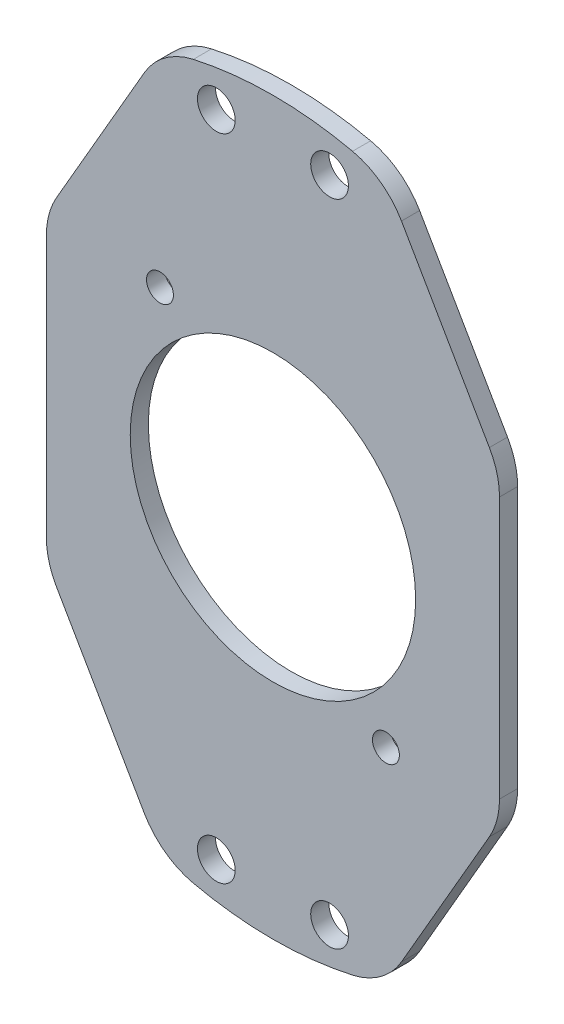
ISO-10303-21;
HEADER;
FILE_DESCRIPTION(('STEP AP214'),'2;1');
FILE_NAME('part.step','',(''),(''),'','','');
FILE_SCHEMA(('AUTOMOTIVE_DESIGN { 1 0 10303 214 1 1 1 1 }'));
ENDSEC;
DATA;
#1=APPLICATION_CONTEXT('core data for automotive mechanical design processes');
#2=APPLICATION_PROTOCOL_DEFINITION('international standard','automotive_design',2000,#1);
#3=PRODUCT_CONTEXT('',#1,'mechanical');
#4=PRODUCT('Part','Part','',(#3));
#5=PRODUCT_RELATED_PRODUCT_CATEGORY('part','',(#4));
#6=PRODUCT_DEFINITION_FORMATION('','',#4);
#7=PRODUCT_DEFINITION_CONTEXT('part definition',#1,'design');
#8=PRODUCT_DEFINITION('design','',#6,#7);
#9=PRODUCT_DEFINITION_SHAPE('','',#8);
#10=(LENGTH_UNIT() NAMED_UNIT(*) SI_UNIT(.MILLI.,.METRE.));
#11=(NAMED_UNIT(*) PLANE_ANGLE_UNIT() SI_UNIT($,.RADIAN.));
#12=(NAMED_UNIT(*) SI_UNIT($,.STERADIAN.) SOLID_ANGLE_UNIT());
#13=UNCERTAINTY_MEASURE_WITH_UNIT(LENGTH_MEASURE(1.E-05),#10,'distance_accuracy_value','');
#14=(GEOMETRIC_REPRESENTATION_CONTEXT(3) GLOBAL_UNCERTAINTY_ASSIGNED_CONTEXT((#13)) GLOBAL_UNIT_ASSIGNED_CONTEXT((#10,
#11,#12)) REPRESENTATION_CONTEXT('',''));
#15=CARTESIAN_POINT('',(0.,0.,0.));
#16=DIRECTION('',(0.,0.,1.));
#17=DIRECTION('',(1.,0.,0.));
#18=AXIS2_PLACEMENT_3D('',#15,#16,#17);
#19=CARTESIAN_POINT('',(-18.288,23.7459436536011,0.));
#20=DIRECTION('',(0.,0.,-1.));
#21=DIRECTION('',(-1.,0.,0.));
#22=AXIS2_PLACEMENT_3D('',#19,#20,#21);
#23=PLANE('',#22);
#24=DIRECTION('',(0.,1.,0.));
#25=VECTOR('',#24,1.);
#26=CARTESIAN_POINT('',(19.05,23.7459436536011,0.));
#27=LINE('',#26,#25);
#28=CARTESIAN_POINT('',(19.05,-10.9985226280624,0.));
#29=VERTEX_POINT('',#28);
#30=CARTESIAN_POINT('',(19.05,10.9985226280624,0.));
#31=VERTEX_POINT('',#30);
#32=EDGE_CURVE('E175',#29,#31,#27,.T.);
#33=ORIENTED_EDGE('',*,*,#32,.F.);
#34=CARTESIAN_POINT('',(12.7,-10.9985226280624,0.));
#35=DIRECTION('',(0.,0.,-1.));
#36=DIRECTION('',(-1.,0.,0.));
#37=AXIS2_PLACEMENT_3D('',#34,#35,#36);
#38=CIRCLE('',#37,6.35);
#39=CARTESIAN_POINT('',(18.1992613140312,-14.1735226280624,0.));
#40=VERTEX_POINT('',#39);
#41=EDGE_CURVE('E169',#29,#40,#38,.T.);
#42=ORIENTED_EDGE('',*,*,#41,.T.);
#43=DIRECTION('',(-0.500000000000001,-0.866025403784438,0.));
#44=VECTOR('',#43,1.);
#45=CARTESIAN_POINT('',(7.14121364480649,-33.3266230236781,0.));
#46=LINE('',#45,#44);
#47=CARTESIAN_POINT('',(10.8089751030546,-26.9738738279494,0.));
#48=VERTEX_POINT('',#47);
#49=EDGE_CURVE('E172',#40,#48,#46,.T.);
#50=ORIENTED_EDGE('',*,*,#49,.T.);
#51=CARTESIAN_POINT('',(5.30971378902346,-23.7988738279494,0.));
#52=DIRECTION('',(0.,0.,-1.));
#53=DIRECTION('',(-1.,0.,0.));
#54=AXIS2_PLACEMENT_3D('',#51,#52,#53);
#55=CIRCLE('',#54,6.35);
#56=CARTESIAN_POINT('',(6.69245175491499,-29.9964972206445,0.));
#57=VERTEX_POINT('',#56);
#58=EDGE_CURVE('E221',#48,#57,#55,.T.);
#59=ORIENTED_EDGE('',*,*,#58,.T.);
#60=CARTESIAN_POINT('',(0.,0.,0.));
#61=DIRECTION('',(0.,0.,1.));
#62=DIRECTION('',(1.,0.,0.));
#63=AXIS2_PLACEMENT_3D('',#60,#61,#62);
#64=CIRCLE('',#63,30.734);
#65=CARTESIAN_POINT('',(-6.69245175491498,-29.9964972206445,0.));
#66=VERTEX_POINT('',#65);
#67=EDGE_CURVE('E262',#66,#57,#64,.T.);
#68=ORIENTED_EDGE('',*,*,#67,.F.);
#69=CARTESIAN_POINT('',(-5.30971378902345,-23.7988738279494,0.));
#70=DIRECTION('',(0.,0.,-1.));
#71=DIRECTION('',(-1.,0.,0.));
#72=AXIS2_PLACEMENT_3D('',#69,#70,#71);
#73=CIRCLE('',#72,6.35);
#74=CARTESIAN_POINT('',(-10.8089751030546,-26.9738738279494,0.));
#75=VERTEX_POINT('',#74);
#76=EDGE_CURVE('E223',#66,#75,#73,.T.);
#77=ORIENTED_EDGE('',*,*,#76,.T.);
#78=DIRECTION('',(-0.500000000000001,0.866025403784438,0.));
#79=VECTOR('',#78,1.);
#80=CARTESIAN_POINT('',(-7.14121364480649,-33.3266230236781,0.));
#81=LINE('',#80,#79);
#82=CARTESIAN_POINT('',(-18.1992613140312,-14.1735226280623,0.));
#83=VERTEX_POINT('',#82);
#84=EDGE_CURVE('E313',#75,#83,#81,.T.);
#85=ORIENTED_EDGE('',*,*,#84,.T.);
#86=CARTESIAN_POINT('',(-12.7,-10.9985226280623,0.));
#87=DIRECTION('',(0.,0.,-1.));
#88=DIRECTION('',(-1.,0.,0.));
#89=AXIS2_PLACEMENT_3D('',#86,#87,#88);
#90=CIRCLE('',#89,6.35);
#91=CARTESIAN_POINT('',(-19.05,-10.9985226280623,0.));
#92=VERTEX_POINT('',#91);
#93=EDGE_CURVE('E225',#83,#92,#90,.T.);
#94=ORIENTED_EDGE('',*,*,#93,.T.);
#95=DIRECTION('',(0.,-1.,0.));
#96=VECTOR('',#95,1.);
#97=CARTESIAN_POINT('',(-19.05,23.7459436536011,0.));
#98=LINE('',#97,#96);
#99=CARTESIAN_POINT('',(-19.05,10.9985226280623,0.));
#100=VERTEX_POINT('',#99);
#101=EDGE_CURVE('E281',#100,#92,#98,.T.);
#102=ORIENTED_EDGE('',*,*,#101,.F.);
#103=CARTESIAN_POINT('',(-12.7,10.9985226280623,0.));
#104=DIRECTION('',(0.,0.,-1.));
#105=DIRECTION('',(-1.,0.,0.));
#106=AXIS2_PLACEMENT_3D('',#103,#104,#105);
#107=CIRCLE('',#106,6.35);
#108=CARTESIAN_POINT('',(-18.1992613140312,14.1735226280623,0.));
#109=VERTEX_POINT('',#108);
#110=EDGE_CURVE('E227',#100,#109,#107,.T.);
#111=ORIENTED_EDGE('',*,*,#110,.T.);
#112=DIRECTION('',(0.500000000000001,0.866025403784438,0.));
#113=VECTOR('',#112,1.);
#114=CARTESIAN_POINT('',(-7.14121364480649,33.3266230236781,0.));
#115=LINE('',#114,#113);
#116=CARTESIAN_POINT('',(-10.8089751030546,26.9738738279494,0.));
#117=VERTEX_POINT('',#116);
#118=EDGE_CURVE('E304',#109,#117,#115,.T.);
#119=ORIENTED_EDGE('',*,*,#118,.T.);
#120=CARTESIAN_POINT('',(-5.30971378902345,23.7988738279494,0.));
#121=DIRECTION('',(0.,0.,-1.));
#122=DIRECTION('',(-1.,0.,0.));
#123=AXIS2_PLACEMENT_3D('',#120,#121,#122);
#124=CIRCLE('',#123,6.35);
#125=CARTESIAN_POINT('',(-6.69245175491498,29.9964972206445,0.));
#126=VERTEX_POINT('',#125);
#127=EDGE_CURVE('E219',#117,#126,#124,.T.);
#128=ORIENTED_EDGE('',*,*,#127,.T.);
#129=CARTESIAN_POINT('',(0.,0.,0.));
#130=DIRECTION('',(0.,0.,1.));
#131=DIRECTION('',(1.,0.,0.));
#132=AXIS2_PLACEMENT_3D('',#129,#130,#131);
#133=CIRCLE('',#132,30.734);
#134=CARTESIAN_POINT('',(6.69245175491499,29.9964972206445,0.));
#135=VERTEX_POINT('',#134);
#136=EDGE_CURVE('E275',#135,#126,#133,.T.);
#137=ORIENTED_EDGE('',*,*,#136,.F.);
#138=CARTESIAN_POINT('',(5.30971378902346,23.7988738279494,0.));
#139=DIRECTION('',(0.,0.,-1.));
#140=DIRECTION('',(-1.,0.,0.));
#141=AXIS2_PLACEMENT_3D('',#138,#139,#140);
#142=CIRCLE('',#141,6.35);
#143=CARTESIAN_POINT('',(10.8089751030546,26.9738738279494,0.));
#144=VERTEX_POINT('',#143);
#145=EDGE_CURVE('E77',#135,#144,#142,.T.);
#146=ORIENTED_EDGE('',*,*,#145,.T.);
#147=DIRECTION('',(0.500000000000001,-0.866025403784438,0.));
#148=VECTOR('',#147,1.);
#149=CARTESIAN_POINT('',(7.14121364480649,33.3266230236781,0.));
#150=LINE('',#149,#148);
#151=CARTESIAN_POINT('',(18.1992613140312,14.1735226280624,0.));
#152=VERTEX_POINT('',#151);
#153=EDGE_CURVE('E306',#144,#152,#150,.T.);
#154=ORIENTED_EDGE('',*,*,#153,.T.);
#155=CARTESIAN_POINT('',(12.7,10.9985226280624,0.));
#156=DIRECTION('',(0.,0.,-1.));
#157=DIRECTION('',(-1.,0.,0.));
#158=AXIS2_PLACEMENT_3D('',#155,#156,#157);
#159=CIRCLE('',#158,6.35);
#160=EDGE_CURVE('E180',#152,#31,#159,.T.);
#161=ORIENTED_EDGE('',*,*,#160,.T.);
#162=EDGE_LOOP('',(#33,#42,#50,#59,#68,#77,#85,#94,#102,#111,#119,#128,#137,#146,#154,#161));
#163=FACE_BOUND('',#162,.T.);
#164=CARTESIAN_POINT('',(-9.49959999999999,11.9888,0.));
#165=DIRECTION('',(0.,0.,1.));
#166=DIRECTION('',(1.,0.,0.));
#167=AXIS2_PLACEMENT_3D('',#164,#165,#166);
#168=CIRCLE('',#167,1.1303);
#169=CARTESIAN_POINT('',(-8.36929999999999,11.9888,0.));
#170=VERTEX_POINT('',#169);
#171=EDGE_CURVE('E321',#170,#170,#168,.T.);
#172=ORIENTED_EDGE('',*,*,#171,.T.);
#173=EDGE_LOOP('',(#172));
#174=FACE_BOUND('',#173,.T.);
#175=CARTESIAN_POINT('',(0.,0.,0.));
#176=DIRECTION('',(0.,0.,1.));
#177=DIRECTION('',(1.,0.,0.));
#178=AXIS2_PLACEMENT_3D('',#175,#176,#177);
#179=CIRCLE('',#178,12.);
#180=CARTESIAN_POINT('',(-12.,0.,0.));
#181=VERTEX_POINT('',#180);
#182=EDGE_CURVE('E330',#181,#181,#179,.T.);
#183=ORIENTED_EDGE('',*,*,#182,.T.);
#184=EDGE_LOOP('',(#183));
#185=FACE_BOUND('',#184,.T.);
#186=CARTESIAN_POINT('',(4.7625,-27.305,0.));
#187=DIRECTION('',(0.,0.,1.));
#188=DIRECTION('',(1.,0.,0.));
#189=AXIS2_PLACEMENT_3D('',#186,#187,#188);
#190=CIRCLE('',#189,1.5875);
#191=CARTESIAN_POINT('',(3.175,-27.305,0.));
#192=VERTEX_POINT('',#191);
#193=EDGE_CURVE('E340',#192,#192,#190,.T.);
#194=ORIENTED_EDGE('',*,*,#193,.T.);
#195=EDGE_LOOP('',(#194));
#196=FACE_BOUND('',#195,.T.);
#197=CARTESIAN_POINT('',(-4.7625,27.305,0.));
#198=DIRECTION('',(0.,0.,1.));
#199=DIRECTION('',(1.,0.,0.));
#200=AXIS2_PLACEMENT_3D('',#197,#198,#199);
#201=CIRCLE('',#200,1.5875);
#202=CARTESIAN_POINT('',(-6.35,27.305,0.));
#203=VERTEX_POINT('',#202);
#204=EDGE_CURVE('E352',#203,#203,#201,.T.);
#205=ORIENTED_EDGE('',*,*,#204,.T.);
#206=EDGE_LOOP('',(#205));
#207=FACE_BOUND('',#206,.T.);
#208=CARTESIAN_POINT('',(4.7625,27.305,0.));
#209=DIRECTION('',(0.,0.,1.));
#210=DIRECTION('',(-1.,0.,0.));
#211=AXIS2_PLACEMENT_3D('',#208,#209,#210);
#212=CIRCLE('',#211,1.5875);
#213=CARTESIAN_POINT('',(3.175,27.305,0.));
#214=VERTEX_POINT('',#213);
#215=EDGE_CURVE('E346',#214,#214,#212,.T.);
#216=ORIENTED_EDGE('',*,*,#215,.T.);
#217=EDGE_LOOP('',(#216));
#218=FACE_BOUND('',#217,.T.);
#219=CARTESIAN_POINT('',(-4.7625,-27.305,0.));
#220=DIRECTION('',(0.,0.,1.));
#221=DIRECTION('',(-1.,0.,0.));
#222=AXIS2_PLACEMENT_3D('',#219,#220,#221);
#223=CIRCLE('',#222,1.5875);
#224=CARTESIAN_POINT('',(-6.35,-27.305,0.));
#225=VERTEX_POINT('',#224);
#226=EDGE_CURVE('E334',#225,#225,#223,.T.);
#227=ORIENTED_EDGE('',*,*,#226,.T.);
#228=EDGE_LOOP('',(#227));
#229=FACE_BOUND('',#228,.T.);
#230=CARTESIAN_POINT('',(9.4996,-12.0142,0.));
#231=DIRECTION('',(0.,0.,1.));
#232=DIRECTION('',(1.,0.,0.));
#233=AXIS2_PLACEMENT_3D('',#230,#231,#232);
#234=CIRCLE('',#233,1.1303);
#235=CARTESIAN_POINT('',(10.6299,-12.0142,0.));
#236=VERTEX_POINT('',#235);
#237=EDGE_CURVE('E327',#236,#236,#234,.T.);
#238=ORIENTED_EDGE('',*,*,#237,.T.);
#239=EDGE_LOOP('',(#238));
#240=FACE_BOUND('',#239,.T.);
#241=ADVANCED_FACE('F55',(#163,#174,#185,#196,#207,#218,#229,#240),#23,.T.);
#242=CARTESIAN_POINT('',(-18.288,23.7459436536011,1.524));
#243=DIRECTION('',(0.,0.,-1.));
#244=DIRECTION('',(-1.,0.,0.));
#245=AXIS2_PLACEMENT_3D('',#242,#243,#244);
#246=PLANE('',#245);
#247=CARTESIAN_POINT('',(-9.49959999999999,11.9888,1.524));
#248=DIRECTION('',(0.,0.,1.));
#249=DIRECTION('',(1.,0.,0.));
#250=AXIS2_PLACEMENT_3D('',#247,#248,#249);
#251=CIRCLE('',#250,1.1303);
#252=CARTESIAN_POINT('',(-8.36929999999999,11.9888,1.524));
#253=VERTEX_POINT('',#252);
#254=EDGE_CURVE('E317',#253,#253,#251,.T.);
#255=ORIENTED_EDGE('',*,*,#254,.F.);
#256=EDGE_LOOP('',(#255));
#257=FACE_BOUND('',#256,.T.);
#258=CARTESIAN_POINT('',(9.4996,-12.0142,1.524));
#259=DIRECTION('',(0.,0.,1.));
#260=DIRECTION('',(1.,0.,0.));
#261=AXIS2_PLACEMENT_3D('',#258,#259,#260);
#262=CIRCLE('',#261,1.1303);
#263=CARTESIAN_POINT('',(10.6299,-12.0142,1.524));
#264=VERTEX_POINT('',#263);
#265=EDGE_CURVE('E324',#264,#264,#262,.T.);
#266=ORIENTED_EDGE('',*,*,#265,.F.);
#267=EDGE_LOOP('',(#266));
#268=FACE_BOUND('',#267,.T.);
#269=DIRECTION('',(-0.500000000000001,-0.866025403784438,0.));
#270=VECTOR('',#269,1.);
#271=CARTESIAN_POINT('',(7.14121364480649,-33.3266230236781,1.524));
#272=LINE('',#271,#270);
#273=CARTESIAN_POINT('',(18.1992613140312,-14.1735226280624,1.524));
#274=VERTEX_POINT('',#273);
#275=CARTESIAN_POINT('',(10.8089751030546,-26.9738738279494,1.524));
#276=VERTEX_POINT('',#275);
#277=EDGE_CURVE('E190',#274,#276,#272,.T.);
#278=ORIENTED_EDGE('',*,*,#277,.F.);
#279=CARTESIAN_POINT('',(12.7,-10.9985226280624,1.524));
#280=DIRECTION('',(0.,0.,-1.));
#281=DIRECTION('',(-1.,0.,0.));
#282=AXIS2_PLACEMENT_3D('',#279,#280,#281);
#283=CIRCLE('',#282,6.35);
#284=CARTESIAN_POINT('',(19.05,-10.9985226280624,1.524));
#285=VERTEX_POINT('',#284);
#286=EDGE_CURVE('E193',#274,#285,#283,.F.);
#287=ORIENTED_EDGE('',*,*,#286,.T.);
#288=DIRECTION('',(0.,1.,0.));
#289=VECTOR('',#288,1.);
#290=CARTESIAN_POINT('',(19.05,23.7459436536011,1.524));
#291=LINE('',#290,#289);
#292=CARTESIAN_POINT('',(19.05,10.9985226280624,1.524));
#293=VERTEX_POINT('',#292);
#294=EDGE_CURVE('E269',#285,#293,#291,.T.);
#295=ORIENTED_EDGE('',*,*,#294,.T.);
#296=CARTESIAN_POINT('',(12.7,10.9985226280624,1.524));
#297=DIRECTION('',(0.,0.,-1.));
#298=DIRECTION('',(-1.,0.,0.));
#299=AXIS2_PLACEMENT_3D('',#296,#297,#298);
#300=CIRCLE('',#299,6.35);
#301=CARTESIAN_POINT('',(18.1992613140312,14.1735226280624,1.524));
#302=VERTEX_POINT('',#301);
#303=EDGE_CURVE('E211',#293,#302,#300,.F.);
#304=ORIENTED_EDGE('',*,*,#303,.T.);
#305=DIRECTION('',(0.500000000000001,-0.866025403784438,0.));
#306=VECTOR('',#305,1.);
#307=CARTESIAN_POINT('',(7.14121364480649,33.3266230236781,1.524));
#308=LINE('',#307,#306);
#309=CARTESIAN_POINT('',(10.8089751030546,26.9738738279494,1.524));
#310=VERTEX_POINT('',#309);
#311=EDGE_CURVE('E303',#310,#302,#308,.T.);
#312=ORIENTED_EDGE('',*,*,#311,.F.);
#313=CARTESIAN_POINT('',(5.30971378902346,23.7988738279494,1.524));
#314=DIRECTION('',(0.,0.,-1.));
#315=DIRECTION('',(-1.,0.,0.));
#316=AXIS2_PLACEMENT_3D('',#313,#314,#315);
#317=CIRCLE('',#316,6.35);
#318=CARTESIAN_POINT('',(6.69245175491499,29.9964972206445,1.524));
#319=VERTEX_POINT('',#318);
#320=EDGE_CURVE('E209',#310,#319,#317,.F.);
#321=ORIENTED_EDGE('',*,*,#320,.T.);
#322=CARTESIAN_POINT('',(0.,0.,1.524));
#323=DIRECTION('',(0.,0.,1.));
#324=DIRECTION('',(1.,0.,0.));
#325=AXIS2_PLACEMENT_3D('',#322,#323,#324);
#326=CIRCLE('',#325,30.734);
#327=CARTESIAN_POINT('',(-6.69245175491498,29.9964972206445,1.524));
#328=VERTEX_POINT('',#327);
#329=EDGE_CURVE('E198',#319,#328,#326,.T.);
#330=ORIENTED_EDGE('',*,*,#329,.T.);
#331=CARTESIAN_POINT('',(-5.30971378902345,23.7988738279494,1.524));
#332=DIRECTION('',(0.,0.,-1.));
#333=DIRECTION('',(-1.,0.,0.));
#334=AXIS2_PLACEMENT_3D('',#331,#332,#333);
#335=CIRCLE('',#334,6.35);
#336=CARTESIAN_POINT('',(-10.8089751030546,26.9738738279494,1.524));
#337=VERTEX_POINT('',#336);
#338=EDGE_CURVE('E194',#328,#337,#335,.F.);
#339=ORIENTED_EDGE('',*,*,#338,.T.);
#340=DIRECTION('',(0.500000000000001,0.866025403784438,0.));
#341=VECTOR('',#340,1.);
#342=CARTESIAN_POINT('',(-7.14121364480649,33.3266230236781,1.524));
#343=LINE('',#342,#341);
#344=CARTESIAN_POINT('',(-18.1992613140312,14.1735226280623,1.524));
#345=VERTEX_POINT('',#344);
#346=EDGE_CURVE('E297',#345,#337,#343,.T.);
#347=ORIENTED_EDGE('',*,*,#346,.F.);
#348=CARTESIAN_POINT('',(-12.7,10.9985226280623,1.524));
#349=DIRECTION('',(0.,0.,-1.));
#350=DIRECTION('',(-1.,0.,0.));
#351=AXIS2_PLACEMENT_3D('',#348,#349,#350);
#352=CIRCLE('',#351,6.35);
#353=CARTESIAN_POINT('',(-19.05,10.9985226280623,1.524));
#354=VERTEX_POINT('',#353);
#355=EDGE_CURVE('E207',#345,#354,#352,.F.);
#356=ORIENTED_EDGE('',*,*,#355,.T.);
#357=DIRECTION('',(0.,-1.,0.));
#358=VECTOR('',#357,1.);
#359=CARTESIAN_POINT('',(-19.05,23.7459436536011,1.524));
#360=LINE('',#359,#358);
#361=CARTESIAN_POINT('',(-19.05,-10.9985226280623,1.524));
#362=VERTEX_POINT('',#361);
#363=EDGE_CURVE('E270',#354,#362,#360,.T.);
#364=ORIENTED_EDGE('',*,*,#363,.T.);
#365=CARTESIAN_POINT('',(-12.7,-10.9985226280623,1.524));
#366=DIRECTION('',(0.,0.,-1.));
#367=DIRECTION('',(-1.,0.,0.));
#368=AXIS2_PLACEMENT_3D('',#365,#366,#367);
#369=CIRCLE('',#368,6.35);
#370=CARTESIAN_POINT('',(-18.1992613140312,-14.1735226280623,1.524));
#371=VERTEX_POINT('',#370);
#372=EDGE_CURVE('E205',#362,#371,#369,.F.);
#373=ORIENTED_EDGE('',*,*,#372,.T.);
#374=DIRECTION('',(-0.500000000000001,0.866025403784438,0.));
#375=VECTOR('',#374,1.);
#376=CARTESIAN_POINT('',(-7.14121364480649,-33.3266230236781,1.524));
#377=LINE('',#376,#375);
#378=CARTESIAN_POINT('',(-10.8089751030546,-26.9738738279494,1.524));
#379=VERTEX_POINT('',#378);
#380=EDGE_CURVE('E308',#379,#371,#377,.T.);
#381=ORIENTED_EDGE('',*,*,#380,.F.);
#382=CARTESIAN_POINT('',(-5.30971378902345,-23.7988738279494,1.524));
#383=DIRECTION('',(0.,0.,-1.));
#384=DIRECTION('',(-1.,0.,0.));
#385=AXIS2_PLACEMENT_3D('',#382,#383,#384);
#386=CIRCLE('',#385,6.35);
#387=CARTESIAN_POINT('',(-6.69245175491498,-29.9964972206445,1.524));
#388=VERTEX_POINT('',#387);
#389=EDGE_CURVE('E203',#379,#388,#386,.F.);
#390=ORIENTED_EDGE('',*,*,#389,.T.);
#391=CARTESIAN_POINT('',(0.,0.,1.524));
#392=DIRECTION('',(0.,0.,1.));
#393=DIRECTION('',(1.,0.,0.));
#394=AXIS2_PLACEMENT_3D('',#391,#392,#393);
#395=CIRCLE('',#394,30.734);
#396=CARTESIAN_POINT('',(6.69245175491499,-29.9964972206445,1.524));
#397=VERTEX_POINT('',#396);
#398=EDGE_CURVE('E259',#388,#397,#395,.T.);
#399=ORIENTED_EDGE('',*,*,#398,.T.);
#400=CARTESIAN_POINT('',(5.30971378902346,-23.7988738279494,1.524));
#401=DIRECTION('',(0.,0.,-1.));
#402=DIRECTION('',(-1.,0.,0.));
#403=AXIS2_PLACEMENT_3D('',#400,#401,#402);
#404=CIRCLE('',#403,6.35);
#405=EDGE_CURVE('E196',#397,#276,#404,.F.);
#406=ORIENTED_EDGE('',*,*,#405,.T.);
#407=EDGE_LOOP('',(#278,#287,#295,#304,#312,#321,#330,#339,#347,#356,#364,#373,#381,#390,#399,#406));
#408=FACE_BOUND('',#407,.T.);
#409=CARTESIAN_POINT('',(-4.7625,27.305,1.524));
#410=DIRECTION('',(0.,0.,1.));
#411=DIRECTION('',(1.,0.,0.));
#412=AXIS2_PLACEMENT_3D('',#409,#410,#411);
#413=CIRCLE('',#412,1.5875);
#414=CARTESIAN_POINT('',(-6.35,27.305,1.524));
#415=VERTEX_POINT('',#414);
#416=EDGE_CURVE('E284',#415,#415,#413,.T.);
#417=ORIENTED_EDGE('',*,*,#416,.F.);
#418=EDGE_LOOP('',(#417));
#419=FACE_BOUND('',#418,.T.);
#420=CARTESIAN_POINT('',(4.7625,27.305,1.524));
#421=DIRECTION('',(0.,0.,1.));
#422=DIRECTION('',(-1.,0.,0.));
#423=AXIS2_PLACEMENT_3D('',#420,#421,#422);
#424=CIRCLE('',#423,1.5875);
#425=CARTESIAN_POINT('',(3.175,27.305,1.524));
#426=VERTEX_POINT('',#425);
#427=EDGE_CURVE('E349',#426,#426,#424,.T.);
#428=ORIENTED_EDGE('',*,*,#427,.F.);
#429=EDGE_LOOP('',(#428));
#430=FACE_BOUND('',#429,.T.);
#431=CARTESIAN_POINT('',(4.7625,-27.305,1.524));
#432=DIRECTION('',(0.,0.,1.));
#433=DIRECTION('',(1.,0.,0.));
#434=AXIS2_PLACEMENT_3D('',#431,#432,#433);
#435=CIRCLE('',#434,1.5875);
#436=CARTESIAN_POINT('',(3.175,-27.305,1.524));
#437=VERTEX_POINT('',#436);
#438=EDGE_CURVE('E343',#437,#437,#435,.T.);
#439=ORIENTED_EDGE('',*,*,#438,.F.);
#440=EDGE_LOOP('',(#439));
#441=FACE_BOUND('',#440,.T.);
#442=CARTESIAN_POINT('',(-4.7625,-27.305,1.524));
#443=DIRECTION('',(0.,0.,1.));
#444=DIRECTION('',(-1.,0.,0.));
#445=AXIS2_PLACEMENT_3D('',#442,#443,#444);
#446=CIRCLE('',#445,1.5875);
#447=CARTESIAN_POINT('',(-6.35,-27.305,1.524));
#448=VERTEX_POINT('',#447);
#449=EDGE_CURVE('E337',#448,#448,#446,.T.);
#450=ORIENTED_EDGE('',*,*,#449,.F.);
#451=EDGE_LOOP('',(#450));
#452=FACE_BOUND('',#451,.T.);
#453=CARTESIAN_POINT('',(0.,0.,1.524));
#454=DIRECTION('',(0.,0.,1.));
#455=DIRECTION('',(1.,0.,0.));
#456=AXIS2_PLACEMENT_3D('',#453,#454,#455);
#457=CIRCLE('',#456,12.);
#458=CARTESIAN_POINT('',(-12.,0.,1.524));
#459=VERTEX_POINT('',#458);
#460=EDGE_CURVE('E331',#459,#459,#457,.T.);
#461=ORIENTED_EDGE('',*,*,#460,.F.);
#462=EDGE_LOOP('',(#461));
#463=FACE_BOUND('',#462,.T.);
#464=ADVANCED_FACE('F265',(#257,#268,#408,#419,#430,#441,#452,#463),#246,.F.);
#465=CARTESIAN_POINT('',(-19.05,23.7459436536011,1.524));
#466=DIRECTION('',(1.,0.,0.));
#467=DIRECTION('',(0.,0.,-1.));
#468=AXIS2_PLACEMENT_3D('',#465,#466,#467);
#469=PLANE('',#468);
#470=ORIENTED_EDGE('',*,*,#363,.F.);
#471=DIRECTION('',(0.,0.,1.));
#472=VECTOR('',#471,1.);
#473=CARTESIAN_POINT('',(-19.05,10.9985226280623,1.524));
#474=LINE('',#473,#472);
#475=EDGE_CURVE('E247',#354,#100,#474,.F.);
#476=ORIENTED_EDGE('',*,*,#475,.T.);
#477=ORIENTED_EDGE('',*,*,#101,.T.);
#478=DIRECTION('',(0.,0.,1.));
#479=VECTOR('',#478,1.);
#480=CARTESIAN_POINT('',(-19.05,-10.9985226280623,1.524));
#481=LINE('',#480,#479);
#482=EDGE_CURVE('E244',#92,#362,#481,.T.);
#483=ORIENTED_EDGE('',*,*,#482,.T.);
#484=EDGE_LOOP('',(#470,#476,#477,#483));
#485=FACE_BOUND('',#484,.T.);
#486=ADVANCED_FACE('F381',(#485),#469,.F.);
#487=CARTESIAN_POINT('',(0.,0.,1.524));
#488=DIRECTION('',(0.,0.,-1.));
#489=DIRECTION('',(-1.,0.,0.));
#490=AXIS2_PLACEMENT_3D('',#487,#488,#489);
#491=CYLINDRICAL_SURFACE('',#490,30.734);
#492=ORIENTED_EDGE('',*,*,#398,.F.);
#493=DIRECTION('',(0.,0.,-1.));
#494=VECTOR('',#493,1.);
#495=CARTESIAN_POINT('',(-6.69245175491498,-29.9964972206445,1.524));
#496=LINE('',#495,#494);
#497=EDGE_CURVE('E13',#388,#66,#496,.T.);
#498=ORIENTED_EDGE('',*,*,#497,.T.);
#499=ORIENTED_EDGE('',*,*,#67,.T.);
#500=DIRECTION('',(0.,0.,-1.));
#501=VECTOR('',#500,1.);
#502=CARTESIAN_POINT('',(6.69245175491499,-29.9964972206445,1.524));
#503=LINE('',#502,#501);
#504=EDGE_CURVE('E63',#57,#397,#503,.F.);
#505=ORIENTED_EDGE('',*,*,#504,.T.);
#506=EDGE_LOOP('',(#492,#498,#499,#505));
#507=FACE_BOUND('',#506,.T.);
#508=ADVANCED_FACE('F258',(#507),#491,.T.);
#509=CARTESIAN_POINT('',(19.05,23.7459436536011,1.524));
#510=DIRECTION('',(-1.,0.,0.));
#511=DIRECTION('',(0.,0.,1.));
#512=AXIS2_PLACEMENT_3D('',#509,#510,#511);
#513=PLANE('',#512);
#514=ORIENTED_EDGE('',*,*,#294,.F.);
#515=DIRECTION('',(0.,0.,1.));
#516=VECTOR('',#515,1.);
#517=CARTESIAN_POINT('',(19.05,-10.9985226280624,1.524));
#518=LINE('',#517,#516);
#519=EDGE_CURVE('E217',#285,#29,#518,.F.);
#520=ORIENTED_EDGE('',*,*,#519,.T.);
#521=ORIENTED_EDGE('',*,*,#32,.T.);
#522=DIRECTION('',(0.,0.,1.));
#523=VECTOR('',#522,1.);
#524=CARTESIAN_POINT('',(19.05,10.9985226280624,1.524));
#525=LINE('',#524,#523);
#526=EDGE_CURVE('E214',#31,#293,#525,.T.);
#527=ORIENTED_EDGE('',*,*,#526,.T.);
#528=EDGE_LOOP('',(#514,#520,#521,#527));
#529=FACE_BOUND('',#528,.T.);
#530=ADVANCED_FACE('F373',(#529),#513,.F.);
#531=CARTESIAN_POINT('',(0.,0.,1.524));
#532=DIRECTION('',(0.,0.,-1.));
#533=DIRECTION('',(-1.,0.,0.));
#534=AXIS2_PLACEMENT_3D('',#531,#532,#533);
#535=CYLINDRICAL_SURFACE('',#534,30.734);
#536=ORIENTED_EDGE('',*,*,#329,.F.);
#537=DIRECTION('',(0.,0.,-1.));
#538=VECTOR('',#537,1.);
#539=CARTESIAN_POINT('',(6.69245175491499,29.9964972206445,1.524));
#540=LINE('',#539,#538);
#541=EDGE_CURVE('E236',#319,#135,#540,.T.);
#542=ORIENTED_EDGE('',*,*,#541,.T.);
#543=ORIENTED_EDGE('',*,*,#136,.T.);
#544=DIRECTION('',(0.,0.,-1.));
#545=VECTOR('',#544,1.);
#546=CARTESIAN_POINT('',(-6.69245175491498,29.9964972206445,1.524));
#547=LINE('',#546,#545);
#548=EDGE_CURVE('E233',#126,#328,#547,.F.);
#549=ORIENTED_EDGE('',*,*,#548,.T.);
#550=EDGE_LOOP('',(#536,#542,#543,#549));
#551=FACE_BOUND('',#550,.T.);
#552=ADVANCED_FACE('F290',(#551),#535,.T.);
#553=CARTESIAN_POINT('',(-4.7625,27.305,1.524));
#554=DIRECTION('',(0.,0.,-1.));
#555=DIRECTION('',(-1.,0.,0.));
#556=AXIS2_PLACEMENT_3D('',#553,#554,#555);
#557=CYLINDRICAL_SURFACE('',#556,1.5875);
#558=CARTESIAN_POINT('',(-6.35,27.305,1.524));
#559=CARTESIAN_POINT('',(-6.35,27.305,1.508125));
#560=CARTESIAN_POINT('',(-6.35,27.305,1.49225));
#561=CARTESIAN_POINT('',(-6.35,27.305,1.4605));
#562=CARTESIAN_POINT('',(-6.35,27.305,1.444625));
#563=CARTESIAN_POINT('',(-6.35,27.305,1.412875));
#564=CARTESIAN_POINT('',(-6.35,27.305,1.397));
#565=CARTESIAN_POINT('',(-6.35,27.305,1.36525));
#566=CARTESIAN_POINT('',(-6.35,27.305,1.349375));
#567=CARTESIAN_POINT('',(-6.35,27.305,1.317625));
#568=CARTESIAN_POINT('',(-6.35,27.305,1.30175));
#569=CARTESIAN_POINT('',(-6.35,27.305,1.27));
#570=CARTESIAN_POINT('',(-6.35,27.305,1.254125));
#571=CARTESIAN_POINT('',(-6.35,27.305,1.222375));
#572=CARTESIAN_POINT('',(-6.35,27.305,1.2065));
#573=CARTESIAN_POINT('',(-6.35,27.305,1.17475));
#574=CARTESIAN_POINT('',(-6.35,27.305,1.158875));
#575=CARTESIAN_POINT('',(-6.35,27.305,1.127125));
#576=CARTESIAN_POINT('',(-6.35,27.305,1.11125));
#577=CARTESIAN_POINT('',(-6.35,27.305,1.0795));
#578=CARTESIAN_POINT('',(-6.35,27.305,1.063625));
#579=CARTESIAN_POINT('',(-6.35,27.305,1.031875));
#580=CARTESIAN_POINT('',(-6.35,27.305,1.016));
#581=CARTESIAN_POINT('',(-6.35,27.305,0.98425));
#582=CARTESIAN_POINT('',(-6.35,27.305,0.968375));
#583=CARTESIAN_POINT('',(-6.35,27.305,0.936625));
#584=CARTESIAN_POINT('',(-6.35,27.305,0.92075));
#585=CARTESIAN_POINT('',(-6.35,27.305,0.889));
#586=CARTESIAN_POINT('',(-6.35,27.305,0.873125));
#587=CARTESIAN_POINT('',(-6.35,27.305,0.841375));
#588=CARTESIAN_POINT('',(-6.35,27.305,0.8255));
#589=CARTESIAN_POINT('',(-6.35,27.305,0.79375));
#590=CARTESIAN_POINT('',(-6.35,27.305,0.777875));
#591=CARTESIAN_POINT('',(-6.35,27.305,0.746125));
#592=CARTESIAN_POINT('',(-6.35,27.305,0.73025));
#593=CARTESIAN_POINT('',(-6.35,27.305,0.6985));
#594=CARTESIAN_POINT('',(-6.35,27.305,0.682625));
#595=CARTESIAN_POINT('',(-6.35,27.305,0.650875));
#596=CARTESIAN_POINT('',(-6.35,27.305,0.635));
#597=CARTESIAN_POINT('',(-6.35,27.305,0.60325));
#598=CARTESIAN_POINT('',(-6.35,27.305,0.587375));
#599=CARTESIAN_POINT('',(-6.35,27.305,0.555625));
#600=CARTESIAN_POINT('',(-6.35,27.305,0.53975));
#601=CARTESIAN_POINT('',(-6.35,27.305,0.508));
#602=CARTESIAN_POINT('',(-6.35,27.305,0.492125));
#603=CARTESIAN_POINT('',(-6.35,27.305,0.460375));
#604=CARTESIAN_POINT('',(-6.35,27.305,0.4445));
#605=CARTESIAN_POINT('',(-6.35,27.305,0.41275));
#606=CARTESIAN_POINT('',(-6.35,27.305,0.396875));
#607=CARTESIAN_POINT('',(-6.35,27.305,0.365125));
#608=CARTESIAN_POINT('',(-6.35,27.305,0.34925));
#609=CARTESIAN_POINT('',(-6.35,27.305,0.3175));
#610=CARTESIAN_POINT('',(-6.35,27.305,0.301625));
#611=CARTESIAN_POINT('',(-6.35,27.305,0.269875));
#612=CARTESIAN_POINT('',(-6.35,27.305,0.254));
#613=CARTESIAN_POINT('',(-6.35,27.305,0.22225));
#614=CARTESIAN_POINT('',(-6.35,27.305,0.206375));
#615=CARTESIAN_POINT('',(-6.35,27.305,0.174625));
#616=CARTESIAN_POINT('',(-6.35,27.305,0.15875));
#617=CARTESIAN_POINT('',(-6.35,27.305,0.127));
#618=CARTESIAN_POINT('',(-6.35,27.305,0.111125));
#619=CARTESIAN_POINT('',(-6.35,27.305,0.079375));
#620=CARTESIAN_POINT('',(-6.35,27.305,0.0635));
#621=CARTESIAN_POINT('',(-6.35,27.305,0.0317499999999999));
#622=CARTESIAN_POINT('',(-6.35,27.305,0.015875));
#623=CARTESIAN_POINT('',(-6.35,27.305,0.));
#624=B_SPLINE_CURVE_WITH_KNOTS('',3,(#558,#559,#560,#561,#562,#563,#564,#565,#566,#567,#568,
#569,#570,#571,#572,#573,#574,#575,#576,#577,#578,#579,#580,#581,#582,#583,#584,#585,#586,#587,
#588,#589,#590,#591,#592,#593,#594,#595,#596,#597,#598,#599,#600,#601,#602,#603,#604,#605,#606,
#607,#608,#609,#610,#611,#612,#613,#614,#615,#616,#617,#618,#619,#620,#621,#622,#623),
.UNSPECIFIED.,.F.,.F.,(4,2,2,2,2,2,2,2,2,2,2,2,2,2,2,2,2,2,2,2,2,2,2,2,2,2,2,2,2,2,2,2,4),(0.,
0.0476250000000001,0.0952500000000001,0.142875,0.1905,0.238125,0.28575,0.333375,0.381,0.428625,
0.47625,0.523875,0.5715,0.619125,0.66675,0.714375,0.762,0.809625,0.85725,0.904875,0.9525,
1.000125,1.04775,1.095375,1.143,1.190625,1.23825,1.285875,1.3335,1.381125,1.42875,1.476375,
1.524),.UNSPECIFIED.);
#625=EDGE_CURVE('BSEAM361',#415,#203,#624,.T.);
#626=ORIENTED_EDGE('',*,*,#416,.T.);
#627=ORIENTED_EDGE('',*,*,#204,.F.);
#628=ORIENTED_EDGE('',*,*,#625,.T.);
#629=ORIENTED_EDGE('',*,*,#625,.F.);
#630=EDGE_LOOP('',(#626,#628,#627,#629));
#631=FACE_BOUND('',#630,.T.);
#632=ADVANCED_FACE('F361',(#631),#557,.F.);
#633=CARTESIAN_POINT('',(4.7625,27.305,1.524));
#634=DIRECTION('',(0.,0.,-1.));
#635=DIRECTION('',(-1.,0.,0.));
#636=AXIS2_PLACEMENT_3D('',#633,#634,#635);
#637=CYLINDRICAL_SURFACE('',#636,1.5875);
#638=CARTESIAN_POINT('',(3.175,27.305,1.524));
#639=CARTESIAN_POINT('',(3.175,27.305,1.508125));
#640=CARTESIAN_POINT('',(3.175,27.305,1.49225));
#641=CARTESIAN_POINT('',(3.175,27.305,1.4605));
#642=CARTESIAN_POINT('',(3.175,27.305,1.444625));
#643=CARTESIAN_POINT('',(3.175,27.305,1.412875));
#644=CARTESIAN_POINT('',(3.175,27.305,1.397));
#645=CARTESIAN_POINT('',(3.175,27.305,1.36525));
#646=CARTESIAN_POINT('',(3.175,27.305,1.349375));
#647=CARTESIAN_POINT('',(3.175,27.305,1.317625));
#648=CARTESIAN_POINT('',(3.175,27.305,1.30175));
#649=CARTESIAN_POINT('',(3.175,27.305,1.27));
#650=CARTESIAN_POINT('',(3.175,27.305,1.254125));
#651=CARTESIAN_POINT('',(3.175,27.305,1.222375));
#652=CARTESIAN_POINT('',(3.175,27.305,1.2065));
#653=CARTESIAN_POINT('',(3.175,27.305,1.17475));
#654=CARTESIAN_POINT('',(3.175,27.305,1.158875));
#655=CARTESIAN_POINT('',(3.175,27.305,1.127125));
#656=CARTESIAN_POINT('',(3.175,27.305,1.11125));
#657=CARTESIAN_POINT('',(3.175,27.305,1.0795));
#658=CARTESIAN_POINT('',(3.175,27.305,1.063625));
#659=CARTESIAN_POINT('',(3.175,27.305,1.031875));
#660=CARTESIAN_POINT('',(3.175,27.305,1.016));
#661=CARTESIAN_POINT('',(3.175,27.305,0.98425));
#662=CARTESIAN_POINT('',(3.175,27.305,0.968375));
#663=CARTESIAN_POINT('',(3.175,27.305,0.936625));
#664=CARTESIAN_POINT('',(3.175,27.305,0.92075));
#665=CARTESIAN_POINT('',(3.175,27.305,0.889));
#666=CARTESIAN_POINT('',(3.175,27.305,0.873125));
#667=CARTESIAN_POINT('',(3.175,27.305,0.841375));
#668=CARTESIAN_POINT('',(3.175,27.305,0.8255));
#669=CARTESIAN_POINT('',(3.175,27.305,0.79375));
#670=CARTESIAN_POINT('',(3.175,27.305,0.777875));
#671=CARTESIAN_POINT('',(3.175,27.305,0.746125));
#672=CARTESIAN_POINT('',(3.175,27.305,0.73025));
#673=CARTESIAN_POINT('',(3.175,27.305,0.6985));
#674=CARTESIAN_POINT('',(3.175,27.305,0.682625));
#675=CARTESIAN_POINT('',(3.175,27.305,0.650875));
#676=CARTESIAN_POINT('',(3.175,27.305,0.635));
#677=CARTESIAN_POINT('',(3.175,27.305,0.60325));
#678=CARTESIAN_POINT('',(3.175,27.305,0.587375));
#679=CARTESIAN_POINT('',(3.175,27.305,0.555625));
#680=CARTESIAN_POINT('',(3.175,27.305,0.53975));
#681=CARTESIAN_POINT('',(3.175,27.305,0.508));
#682=CARTESIAN_POINT('',(3.175,27.305,0.492125));
#683=CARTESIAN_POINT('',(3.175,27.305,0.460375));
#684=CARTESIAN_POINT('',(3.175,27.305,0.4445));
#685=CARTESIAN_POINT('',(3.175,27.305,0.41275));
#686=CARTESIAN_POINT('',(3.175,27.305,0.396875));
#687=CARTESIAN_POINT('',(3.175,27.305,0.365125));
#688=CARTESIAN_POINT('',(3.175,27.305,0.34925));
#689=CARTESIAN_POINT('',(3.175,27.305,0.3175));
#690=CARTESIAN_POINT('',(3.175,27.305,0.301625));
#691=CARTESIAN_POINT('',(3.175,27.305,0.269875));
#692=CARTESIAN_POINT('',(3.175,27.305,0.254));
#693=CARTESIAN_POINT('',(3.175,27.305,0.22225));
#694=CARTESIAN_POINT('',(3.175,27.305,0.206375));
#695=CARTESIAN_POINT('',(3.175,27.305,0.174625));
#696=CARTESIAN_POINT('',(3.175,27.305,0.15875));
#697=CARTESIAN_POINT('',(3.175,27.305,0.127));
#698=CARTESIAN_POINT('',(3.175,27.305,0.111125));
#699=CARTESIAN_POINT('',(3.175,27.305,0.079375));
#700=CARTESIAN_POINT('',(3.175,27.305,0.0635));
#701=CARTESIAN_POINT('',(3.175,27.305,0.0317499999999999));
#702=CARTESIAN_POINT('',(3.175,27.305,0.015875));
#703=CARTESIAN_POINT('',(3.175,27.305,0.));
#704=B_SPLINE_CURVE_WITH_KNOTS('',3,(#638,#639,#640,#641,#642,#643,#644,#645,#646,#647,#648,
#649,#650,#651,#652,#653,#654,#655,#656,#657,#658,#659,#660,#661,#662,#663,#664,#665,#666,#667,
#668,#669,#670,#671,#672,#673,#674,#675,#676,#677,#678,#679,#680,#681,#682,#683,#684,#685,#686,
#687,#688,#689,#690,#691,#692,#693,#694,#695,#696,#697,#698,#699,#700,#701,#702,#703),
.UNSPECIFIED.,.F.,.F.,(4,2,2,2,2,2,2,2,2,2,2,2,2,2,2,2,2,2,2,2,2,2,2,2,2,2,2,2,2,2,2,2,4),(0.,
0.0476250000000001,0.0952500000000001,0.142875,0.1905,0.238125,0.28575,0.333375,0.381,0.428625,
0.47625,0.523875,0.5715,0.619125,0.66675,0.714375,0.762,0.809625,0.85725,0.904875,0.9525,
1.000125,1.04775,1.095375,1.143,1.190625,1.23825,1.285875,1.3335,1.381125,1.42875,1.476375,
1.524),.UNSPECIFIED.);
#705=EDGE_CURVE('BSEAM363',#426,#214,#704,.T.);
#706=ORIENTED_EDGE('',*,*,#427,.T.);
#707=ORIENTED_EDGE('',*,*,#215,.F.);
#708=ORIENTED_EDGE('',*,*,#705,.T.);
#709=ORIENTED_EDGE('',*,*,#705,.F.);
#710=EDGE_LOOP('',(#706,#708,#707,#709));
#711=FACE_BOUND('',#710,.T.);
#712=ADVANCED_FACE('F363',(#711),#637,.F.);
#713=CARTESIAN_POINT('',(4.7625,-27.305,1.524));
#714=DIRECTION('',(0.,0.,-1.));
#715=DIRECTION('',(-1.,0.,0.));
#716=AXIS2_PLACEMENT_3D('',#713,#714,#715);
#717=CYLINDRICAL_SURFACE('',#716,1.5875);
#718=CARTESIAN_POINT('',(3.175,-27.305,1.524));
#719=CARTESIAN_POINT('',(3.175,-27.305,1.508125));
#720=CARTESIAN_POINT('',(3.175,-27.305,1.49225));
#721=CARTESIAN_POINT('',(3.175,-27.305,1.4605));
#722=CARTESIAN_POINT('',(3.175,-27.305,1.444625));
#723=CARTESIAN_POINT('',(3.175,-27.305,1.412875));
#724=CARTESIAN_POINT('',(3.175,-27.305,1.397));
#725=CARTESIAN_POINT('',(3.175,-27.305,1.36525));
#726=CARTESIAN_POINT('',(3.175,-27.305,1.349375));
#727=CARTESIAN_POINT('',(3.175,-27.305,1.317625));
#728=CARTESIAN_POINT('',(3.175,-27.305,1.30175));
#729=CARTESIAN_POINT('',(3.175,-27.305,1.27));
#730=CARTESIAN_POINT('',(3.175,-27.305,1.254125));
#731=CARTESIAN_POINT('',(3.175,-27.305,1.222375));
#732=CARTESIAN_POINT('',(3.175,-27.305,1.2065));
#733=CARTESIAN_POINT('',(3.175,-27.305,1.17475));
#734=CARTESIAN_POINT('',(3.175,-27.305,1.158875));
#735=CARTESIAN_POINT('',(3.175,-27.305,1.127125));
#736=CARTESIAN_POINT('',(3.175,-27.305,1.11125));
#737=CARTESIAN_POINT('',(3.175,-27.305,1.0795));
#738=CARTESIAN_POINT('',(3.175,-27.305,1.063625));
#739=CARTESIAN_POINT('',(3.175,-27.305,1.031875));
#740=CARTESIAN_POINT('',(3.175,-27.305,1.016));
#741=CARTESIAN_POINT('',(3.175,-27.305,0.98425));
#742=CARTESIAN_POINT('',(3.175,-27.305,0.968375));
#743=CARTESIAN_POINT('',(3.175,-27.305,0.936625));
#744=CARTESIAN_POINT('',(3.175,-27.305,0.92075));
#745=CARTESIAN_POINT('',(3.175,-27.305,0.889));
#746=CARTESIAN_POINT('',(3.175,-27.305,0.873125));
#747=CARTESIAN_POINT('',(3.175,-27.305,0.841375));
#748=CARTESIAN_POINT('',(3.175,-27.305,0.8255));
#749=CARTESIAN_POINT('',(3.175,-27.305,0.79375));
#750=CARTESIAN_POINT('',(3.175,-27.305,0.777875));
#751=CARTESIAN_POINT('',(3.175,-27.305,0.746125));
#752=CARTESIAN_POINT('',(3.175,-27.305,0.73025));
#753=CARTESIAN_POINT('',(3.175,-27.305,0.6985));
#754=CARTESIAN_POINT('',(3.175,-27.305,0.682625));
#755=CARTESIAN_POINT('',(3.175,-27.305,0.650875));
#756=CARTESIAN_POINT('',(3.175,-27.305,0.635));
#757=CARTESIAN_POINT('',(3.175,-27.305,0.60325));
#758=CARTESIAN_POINT('',(3.175,-27.305,0.587375));
#759=CARTESIAN_POINT('',(3.175,-27.305,0.555625));
#760=CARTESIAN_POINT('',(3.175,-27.305,0.53975));
#761=CARTESIAN_POINT('',(3.175,-27.305,0.508));
#762=CARTESIAN_POINT('',(3.175,-27.305,0.492125));
#763=CARTESIAN_POINT('',(3.175,-27.305,0.460375));
#764=CARTESIAN_POINT('',(3.175,-27.305,0.4445));
#765=CARTESIAN_POINT('',(3.175,-27.305,0.41275));
#766=CARTESIAN_POINT('',(3.175,-27.305,0.396875));
#767=CARTESIAN_POINT('',(3.175,-27.305,0.365125));
#768=CARTESIAN_POINT('',(3.175,-27.305,0.34925));
#769=CARTESIAN_POINT('',(3.175,-27.305,0.3175));
#770=CARTESIAN_POINT('',(3.175,-27.305,0.301625));
#771=CARTESIAN_POINT('',(3.175,-27.305,0.269875));
#772=CARTESIAN_POINT('',(3.175,-27.305,0.254));
#773=CARTESIAN_POINT('',(3.175,-27.305,0.22225));
#774=CARTESIAN_POINT('',(3.175,-27.305,0.206375));
#775=CARTESIAN_POINT('',(3.175,-27.305,0.174625));
#776=CARTESIAN_POINT('',(3.175,-27.305,0.15875));
#777=CARTESIAN_POINT('',(3.175,-27.305,0.127));
#778=CARTESIAN_POINT('',(3.175,-27.305,0.111125));
#779=CARTESIAN_POINT('',(3.175,-27.305,0.079375));
#780=CARTESIAN_POINT('',(3.175,-27.305,0.0635));
#781=CARTESIAN_POINT('',(3.175,-27.305,0.0317499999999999));
#782=CARTESIAN_POINT('',(3.175,-27.305,0.015875));
#783=CARTESIAN_POINT('',(3.175,-27.305,0.));
#784=B_SPLINE_CURVE_WITH_KNOTS('',3,(#718,#719,#720,#721,#722,#723,#724,#725,#726,#727,#728,
#729,#730,#731,#732,#733,#734,#735,#736,#737,#738,#739,#740,#741,#742,#743,#744,#745,#746,#747,
#748,#749,#750,#751,#752,#753,#754,#755,#756,#757,#758,#759,#760,#761,#762,#763,#764,#765,#766,
#767,#768,#769,#770,#771,#772,#773,#774,#775,#776,#777,#778,#779,#780,#781,#782,#783),
.UNSPECIFIED.,.F.,.F.,(4,2,2,2,2,2,2,2,2,2,2,2,2,2,2,2,2,2,2,2,2,2,2,2,2,2,2,2,2,2,2,2,4),(0.,
0.0476250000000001,0.0952500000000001,0.142875,0.1905,0.238125,0.28575,0.333375,0.381,0.428625,
0.47625,0.523875,0.5715,0.619125,0.66675,0.714375,0.762,0.809625,0.85725,0.904875,0.9525,
1.000125,1.04775,1.095375,1.143,1.190625,1.23825,1.285875,1.3335,1.381125,1.42875,1.476375,
1.524),.UNSPECIFIED.);
#785=EDGE_CURVE('BSEAM370',#437,#192,#784,.T.);
#786=ORIENTED_EDGE('',*,*,#438,.T.);
#787=ORIENTED_EDGE('',*,*,#193,.F.);
#788=ORIENTED_EDGE('',*,*,#785,.T.);
#789=ORIENTED_EDGE('',*,*,#785,.F.);
#790=EDGE_LOOP('',(#786,#788,#787,#789));
#791=FACE_BOUND('',#790,.T.);
#792=ADVANCED_FACE('F370',(#791),#717,.F.);
#793=CARTESIAN_POINT('',(-4.7625,-27.305,1.524));
#794=DIRECTION('',(0.,0.,-1.));
#795=DIRECTION('',(-1.,0.,0.));
#796=AXIS2_PLACEMENT_3D('',#793,#794,#795);
#797=CYLINDRICAL_SURFACE('',#796,1.5875);
#798=CARTESIAN_POINT('',(-6.35,-27.305,1.524));
#799=CARTESIAN_POINT('',(-6.35,-27.305,1.508125));
#800=CARTESIAN_POINT('',(-6.35,-27.305,1.49225));
#801=CARTESIAN_POINT('',(-6.35,-27.305,1.4605));
#802=CARTESIAN_POINT('',(-6.35,-27.305,1.444625));
#803=CARTESIAN_POINT('',(-6.35,-27.305,1.412875));
#804=CARTESIAN_POINT('',(-6.35,-27.305,1.397));
#805=CARTESIAN_POINT('',(-6.35,-27.305,1.36525));
#806=CARTESIAN_POINT('',(-6.35,-27.305,1.349375));
#807=CARTESIAN_POINT('',(-6.35,-27.305,1.317625));
#808=CARTESIAN_POINT('',(-6.35,-27.305,1.30175));
#809=CARTESIAN_POINT('',(-6.35,-27.305,1.27));
#810=CARTESIAN_POINT('',(-6.35,-27.305,1.254125));
#811=CARTESIAN_POINT('',(-6.35,-27.305,1.222375));
#812=CARTESIAN_POINT('',(-6.35,-27.305,1.2065));
#813=CARTESIAN_POINT('',(-6.35,-27.305,1.17475));
#814=CARTESIAN_POINT('',(-6.35,-27.305,1.158875));
#815=CARTESIAN_POINT('',(-6.35,-27.305,1.127125));
#816=CARTESIAN_POINT('',(-6.35,-27.305,1.11125));
#817=CARTESIAN_POINT('',(-6.35,-27.305,1.0795));
#818=CARTESIAN_POINT('',(-6.35,-27.305,1.063625));
#819=CARTESIAN_POINT('',(-6.35,-27.305,1.031875));
#820=CARTESIAN_POINT('',(-6.35,-27.305,1.016));
#821=CARTESIAN_POINT('',(-6.35,-27.305,0.98425));
#822=CARTESIAN_POINT('',(-6.35,-27.305,0.968375));
#823=CARTESIAN_POINT('',(-6.35,-27.305,0.936625));
#824=CARTESIAN_POINT('',(-6.35,-27.305,0.92075));
#825=CARTESIAN_POINT('',(-6.35,-27.305,0.889));
#826=CARTESIAN_POINT('',(-6.35,-27.305,0.873125));
#827=CARTESIAN_POINT('',(-6.35,-27.305,0.841375));
#828=CARTESIAN_POINT('',(-6.35,-27.305,0.8255));
#829=CARTESIAN_POINT('',(-6.35,-27.305,0.79375));
#830=CARTESIAN_POINT('',(-6.35,-27.305,0.777875));
#831=CARTESIAN_POINT('',(-6.35,-27.305,0.746125));
#832=CARTESIAN_POINT('',(-6.35,-27.305,0.73025));
#833=CARTESIAN_POINT('',(-6.35,-27.305,0.6985));
#834=CARTESIAN_POINT('',(-6.35,-27.305,0.682625));
#835=CARTESIAN_POINT('',(-6.35,-27.305,0.650875));
#836=CARTESIAN_POINT('',(-6.35,-27.305,0.635));
#837=CARTESIAN_POINT('',(-6.35,-27.305,0.60325));
#838=CARTESIAN_POINT('',(-6.35,-27.305,0.587375));
#839=CARTESIAN_POINT('',(-6.35,-27.305,0.555625));
#840=CARTESIAN_POINT('',(-6.35,-27.305,0.53975));
#841=CARTESIAN_POINT('',(-6.35,-27.305,0.508));
#842=CARTESIAN_POINT('',(-6.35,-27.305,0.492125));
#843=CARTESIAN_POINT('',(-6.35,-27.305,0.460375));
#844=CARTESIAN_POINT('',(-6.35,-27.305,0.4445));
#845=CARTESIAN_POINT('',(-6.35,-27.305,0.41275));
#846=CARTESIAN_POINT('',(-6.35,-27.305,0.396875));
#847=CARTESIAN_POINT('',(-6.35,-27.305,0.365125));
#848=CARTESIAN_POINT('',(-6.35,-27.305,0.34925));
#849=CARTESIAN_POINT('',(-6.35,-27.305,0.3175));
#850=CARTESIAN_POINT('',(-6.35,-27.305,0.301625));
#851=CARTESIAN_POINT('',(-6.35,-27.305,0.269875));
#852=CARTESIAN_POINT('',(-6.35,-27.305,0.254));
#853=CARTESIAN_POINT('',(-6.35,-27.305,0.22225));
#854=CARTESIAN_POINT('',(-6.35,-27.305,0.206375));
#855=CARTESIAN_POINT('',(-6.35,-27.305,0.174625));
#856=CARTESIAN_POINT('',(-6.35,-27.305,0.15875));
#857=CARTESIAN_POINT('',(-6.35,-27.305,0.127));
#858=CARTESIAN_POINT('',(-6.35,-27.305,0.111125));
#859=CARTESIAN_POINT('',(-6.35,-27.305,0.079375));
#860=CARTESIAN_POINT('',(-6.35,-27.305,0.0635));
#861=CARTESIAN_POINT('',(-6.35,-27.305,0.0317499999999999));
#862=CARTESIAN_POINT('',(-6.35,-27.305,0.015875));
#863=CARTESIAN_POINT('',(-6.35,-27.305,0.));
#864=B_SPLINE_CURVE_WITH_KNOTS('',3,(#798,#799,#800,#801,#802,#803,#804,#805,#806,#807,#808,
#809,#810,#811,#812,#813,#814,#815,#816,#817,#818,#819,#820,#821,#822,#823,#824,#825,#826,#827,
#828,#829,#830,#831,#832,#833,#834,#835,#836,#837,#838,#839,#840,#841,#842,#843,#844,#845,#846,
#847,#848,#849,#850,#851,#852,#853,#854,#855,#856,#857,#858,#859,#860,#861,#862,#863),
.UNSPECIFIED.,.F.,.F.,(4,2,2,2,2,2,2,2,2,2,2,2,2,2,2,2,2,2,2,2,2,2,2,2,2,2,2,2,2,2,2,2,4),(0.,
0.0476250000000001,0.0952500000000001,0.142875,0.1905,0.238125,0.28575,0.333375,0.381,0.428625,
0.47625,0.523875,0.5715,0.619125,0.66675,0.714375,0.762,0.809625,0.85725,0.904875,0.9525,
1.000125,1.04775,1.095375,1.143,1.190625,1.23825,1.285875,1.3335,1.381125,1.42875,1.476375,
1.524),.UNSPECIFIED.);
#865=EDGE_CURVE('BSEAM451',#448,#225,#864,.T.);
#866=ORIENTED_EDGE('',*,*,#449,.T.);
#867=ORIENTED_EDGE('',*,*,#226,.F.);
#868=ORIENTED_EDGE('',*,*,#865,.T.);
#869=ORIENTED_EDGE('',*,*,#865,.F.);
#870=EDGE_LOOP('',(#866,#868,#867,#869));
#871=FACE_BOUND('',#870,.T.);
#872=ADVANCED_FACE('F451',(#871),#797,.F.);
#873=CARTESIAN_POINT('',(0.,0.,1.524));
#874=DIRECTION('',(0.,0.,-1.));
#875=DIRECTION('',(-1.,0.,0.));
#876=AXIS2_PLACEMENT_3D('',#873,#874,#875);
#877=CYLINDRICAL_SURFACE('',#876,12.);
#878=CARTESIAN_POINT('',(-12.,0.,1.524));
#879=CARTESIAN_POINT('',(-12.,0.,1.508125));
#880=CARTESIAN_POINT('',(-12.,0.,1.49225));
#881=CARTESIAN_POINT('',(-12.,0.,1.4605));
#882=CARTESIAN_POINT('',(-12.,0.,1.444625));
#883=CARTESIAN_POINT('',(-12.,0.,1.412875));
#884=CARTESIAN_POINT('',(-12.,0.,1.397));
#885=CARTESIAN_POINT('',(-12.,0.,1.36525));
#886=CARTESIAN_POINT('',(-12.,0.,1.349375));
#887=CARTESIAN_POINT('',(-12.,0.,1.317625));
#888=CARTESIAN_POINT('',(-12.,0.,1.30175));
#889=CARTESIAN_POINT('',(-12.,0.,1.27));
#890=CARTESIAN_POINT('',(-12.,0.,1.254125));
#891=CARTESIAN_POINT('',(-12.,0.,1.222375));
#892=CARTESIAN_POINT('',(-12.,0.,1.2065));
#893=CARTESIAN_POINT('',(-12.,0.,1.17475));
#894=CARTESIAN_POINT('',(-12.,0.,1.158875));
#895=CARTESIAN_POINT('',(-12.,0.,1.127125));
#896=CARTESIAN_POINT('',(-12.,0.,1.11125));
#897=CARTESIAN_POINT('',(-12.,0.,1.0795));
#898=CARTESIAN_POINT('',(-12.,0.,1.063625));
#899=CARTESIAN_POINT('',(-12.,0.,1.031875));
#900=CARTESIAN_POINT('',(-12.,0.,1.016));
#901=CARTESIAN_POINT('',(-12.,0.,0.98425));
#902=CARTESIAN_POINT('',(-12.,0.,0.968375));
#903=CARTESIAN_POINT('',(-12.,0.,0.936625));
#904=CARTESIAN_POINT('',(-12.,0.,0.92075));
#905=CARTESIAN_POINT('',(-12.,0.,0.889));
#906=CARTESIAN_POINT('',(-12.,0.,0.873125));
#907=CARTESIAN_POINT('',(-12.,0.,0.841375));
#908=CARTESIAN_POINT('',(-12.,0.,0.8255));
#909=CARTESIAN_POINT('',(-12.,0.,0.79375));
#910=CARTESIAN_POINT('',(-12.,0.,0.777875));
#911=CARTESIAN_POINT('',(-12.,0.,0.746125));
#912=CARTESIAN_POINT('',(-12.,0.,0.73025));
#913=CARTESIAN_POINT('',(-12.,0.,0.6985));
#914=CARTESIAN_POINT('',(-12.,0.,0.682625));
#915=CARTESIAN_POINT('',(-12.,0.,0.650875));
#916=CARTESIAN_POINT('',(-12.,0.,0.635));
#917=CARTESIAN_POINT('',(-12.,0.,0.60325));
#918=CARTESIAN_POINT('',(-12.,0.,0.587375));
#919=CARTESIAN_POINT('',(-12.,0.,0.555625));
#920=CARTESIAN_POINT('',(-12.,0.,0.53975));
#921=CARTESIAN_POINT('',(-12.,0.,0.508));
#922=CARTESIAN_POINT('',(-12.,0.,0.492125));
#923=CARTESIAN_POINT('',(-12.,0.,0.460375));
#924=CARTESIAN_POINT('',(-12.,0.,0.4445));
#925=CARTESIAN_POINT('',(-12.,0.,0.41275));
#926=CARTESIAN_POINT('',(-12.,0.,0.396875));
#927=CARTESIAN_POINT('',(-12.,0.,0.365125));
#928=CARTESIAN_POINT('',(-12.,0.,0.34925));
#929=CARTESIAN_POINT('',(-12.,0.,0.3175));
#930=CARTESIAN_POINT('',(-12.,0.,0.301625));
#931=CARTESIAN_POINT('',(-12.,0.,0.269875));
#932=CARTESIAN_POINT('',(-12.,0.,0.254));
#933=CARTESIAN_POINT('',(-12.,0.,0.22225));
#934=CARTESIAN_POINT('',(-12.,0.,0.206375));
#935=CARTESIAN_POINT('',(-12.,0.,0.174625));
#936=CARTESIAN_POINT('',(-12.,0.,0.15875));
#937=CARTESIAN_POINT('',(-12.,0.,0.127));
#938=CARTESIAN_POINT('',(-12.,0.,0.111125));
#939=CARTESIAN_POINT('',(-12.,0.,0.079375));
#940=CARTESIAN_POINT('',(-12.,0.,0.0635));
#941=CARTESIAN_POINT('',(-12.,0.,0.0317499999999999));
#942=CARTESIAN_POINT('',(-12.,0.,0.015875));
#943=CARTESIAN_POINT('',(-12.,0.,0.));
#944=B_SPLINE_CURVE_WITH_KNOTS('',3,(#878,#879,#880,#881,#882,#883,#884,#885,#886,#887,#888,
#889,#890,#891,#892,#893,#894,#895,#896,#897,#898,#899,#900,#901,#902,#903,#904,#905,#906,#907,
#908,#909,#910,#911,#912,#913,#914,#915,#916,#917,#918,#919,#920,#921,#922,#923,#924,#925,#926,
#927,#928,#929,#930,#931,#932,#933,#934,#935,#936,#937,#938,#939,#940,#941,#942,#943),
.UNSPECIFIED.,.F.,.F.,(4,2,2,2,2,2,2,2,2,2,2,2,2,2,2,2,2,2,2,2,2,2,2,2,2,2,2,2,2,2,2,2,4),(0.,
0.0476250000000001,0.0952500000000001,0.142875,0.1905,0.238125,0.28575,0.333375,0.381,0.428625,
0.47625,0.523875,0.5715,0.619125,0.66675,0.714375,0.762,0.809625,0.85725,0.904875,0.9525,
1.000125,1.04775,1.095375,1.143,1.190625,1.23825,1.285875,1.3335,1.381125,1.42875,1.476375,
1.524),.UNSPECIFIED.);
#945=EDGE_CURVE('BSEAM447',#459,#181,#944,.T.);
#946=ORIENTED_EDGE('',*,*,#460,.T.);
#947=ORIENTED_EDGE('',*,*,#182,.F.);
#948=ORIENTED_EDGE('',*,*,#945,.T.);
#949=ORIENTED_EDGE('',*,*,#945,.F.);
#950=EDGE_LOOP('',(#946,#948,#947,#949));
#951=FACE_BOUND('',#950,.T.);
#952=ADVANCED_FACE('F447',(#951),#877,.F.);
#953=CARTESIAN_POINT('',(9.4996,-12.0142,1.524));
#954=DIRECTION('',(0.,0.,1.));
#955=DIRECTION('',(1.,0.,0.));
#956=AXIS2_PLACEMENT_3D('',#953,#954,#955);
#957=CYLINDRICAL_SURFACE('',#956,1.1303);
#958=ORIENTED_EDGE('',*,*,#237,.F.);
#959=EDGE_LOOP('',(#958));
#960=FACE_BOUND('',#959,.T.);
#961=ORIENTED_EDGE('',*,*,#265,.T.);
#962=EDGE_LOOP('',(#961));
#963=FACE_BOUND('',#962,.T.);
#964=ADVANCED_FACE('F443',(#960,#963),#957,.F.);
#965=CARTESIAN_POINT('',(-9.49959999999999,11.9888,1.524));
#966=DIRECTION('',(0.,0.,1.));
#967=DIRECTION('',(1.,0.,0.));
#968=AXIS2_PLACEMENT_3D('',#965,#966,#967);
#969=CYLINDRICAL_SURFACE('',#968,1.1303);
#970=ORIENTED_EDGE('',*,*,#171,.F.);
#971=EDGE_LOOP('',(#970));
#972=FACE_BOUND('',#971,.T.);
#973=ORIENTED_EDGE('',*,*,#254,.T.);
#974=EDGE_LOOP('',(#973));
#975=FACE_BOUND('',#974,.T.);
#976=ADVANCED_FACE('F440',(#972,#975),#969,.F.);
#977=CARTESIAN_POINT('',(7.14121364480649,33.3266230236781,0.));
#978=DIRECTION('',(-0.866025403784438,-0.500000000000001,0.));
#979=DIRECTION('',(0.500000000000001,-0.866025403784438,0.));
#980=AXIS2_PLACEMENT_3D('',#977,#978,#979);
#981=PLANE('',#980);
#982=ORIENTED_EDGE('',*,*,#311,.T.);
#983=DIRECTION('',(0.,0.,1.));
#984=VECTOR('',#983,1.);
#985=CARTESIAN_POINT('',(18.1992613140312,14.1735226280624,0.));
#986=LINE('',#985,#984);
#987=EDGE_CURVE('E70',#302,#152,#986,.F.);
#988=ORIENTED_EDGE('',*,*,#987,.T.);
#989=ORIENTED_EDGE('',*,*,#153,.F.);
#990=DIRECTION('',(0.,0.,-1.));
#991=VECTOR('',#990,1.);
#992=CARTESIAN_POINT('',(10.8089751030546,26.9738738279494,0.));
#993=LINE('',#992,#991);
#994=EDGE_CURVE('E179',#144,#310,#993,.F.);
#995=ORIENTED_EDGE('',*,*,#994,.T.);
#996=EDGE_LOOP('',(#982,#988,#989,#995));
#997=FACE_BOUND('',#996,.T.);
#998=ADVANCED_FACE('F437',(#997),#981,.F.);
#999=CARTESIAN_POINT('',(-7.14121364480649,33.3266230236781,0.));
#1000=DIRECTION('',(0.866025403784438,-0.500000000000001,0.));
#1001=DIRECTION('',(0.500000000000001,0.866025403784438,0.));
#1002=AXIS2_PLACEMENT_3D('',#999,#1000,#1001);
#1003=PLANE('',#1002);
#1004=ORIENTED_EDGE('',*,*,#118,.F.);
#1005=DIRECTION('',(0.,0.,1.));
#1006=VECTOR('',#1005,1.);
#1007=CARTESIAN_POINT('',(-18.1992613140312,14.1735226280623,0.));
#1008=LINE('',#1007,#1006);
#1009=EDGE_CURVE('E241',#109,#345,#1008,.T.);
#1010=ORIENTED_EDGE('',*,*,#1009,.T.);
#1011=ORIENTED_EDGE('',*,*,#346,.T.);
#1012=DIRECTION('',(0.,0.,-1.));
#1013=VECTOR('',#1012,1.);
#1014=CARTESIAN_POINT('',(-10.8089751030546,26.9738738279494,0.));
#1015=LINE('',#1014,#1013);
#1016=EDGE_CURVE('E239',#337,#117,#1015,.T.);
#1017=ORIENTED_EDGE('',*,*,#1016,.T.);
#1018=EDGE_LOOP('',(#1004,#1010,#1011,#1017));
#1019=FACE_BOUND('',#1018,.T.);
#1020=ADVANCED_FACE('F300',(#1019),#1003,.F.);
#1021=CARTESIAN_POINT('',(7.14121364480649,-33.3266230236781,0.));
#1022=DIRECTION('',(-0.866025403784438,0.500000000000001,0.));
#1023=DIRECTION('',(-0.500000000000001,-0.866025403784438,0.));
#1024=AXIS2_PLACEMENT_3D('',#1021,#1022,#1023);
#1025=PLANE('',#1024);
#1026=ORIENTED_EDGE('',*,*,#49,.F.);
#1027=DIRECTION('',(0.,0.,1.));
#1028=VECTOR('',#1027,1.);
#1029=CARTESIAN_POINT('',(18.1992613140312,-14.1735226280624,0.));
#1030=LINE('',#1029,#1028);
#1031=EDGE_CURVE('E186',#40,#274,#1030,.T.);
#1032=ORIENTED_EDGE('',*,*,#1031,.T.);
#1033=ORIENTED_EDGE('',*,*,#277,.T.);
#1034=DIRECTION('',(0.,0.,-1.));
#1035=VECTOR('',#1034,1.);
#1036=CARTESIAN_POINT('',(10.8089751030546,-26.9738738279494,0.));
#1037=LINE('',#1036,#1035);
#1038=EDGE_CURVE('E189',#276,#48,#1037,.T.);
#1039=ORIENTED_EDGE('',*,*,#1038,.T.);
#1040=EDGE_LOOP('',(#1026,#1032,#1033,#1039));
#1041=FACE_BOUND('',#1040,.T.);
#1042=ADVANCED_FACE('F184',(#1041),#1025,.F.);
#1043=CARTESIAN_POINT('',(-7.14121364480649,-33.3266230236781,0.));
#1044=DIRECTION('',(0.866025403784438,0.500000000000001,0.));
#1045=DIRECTION('',(-0.500000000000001,0.866025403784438,0.));
#1046=AXIS2_PLACEMENT_3D('',#1043,#1044,#1045);
#1047=PLANE('',#1046);
#1048=ORIENTED_EDGE('',*,*,#380,.T.);
#1049=DIRECTION('',(0.,0.,1.));
#1050=VECTOR('',#1049,1.);
#1051=CARTESIAN_POINT('',(-18.1992613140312,-14.1735226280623,0.));
#1052=LINE('',#1051,#1050);
#1053=EDGE_CURVE('E251',#371,#83,#1052,.F.);
#1054=ORIENTED_EDGE('',*,*,#1053,.T.);
#1055=ORIENTED_EDGE('',*,*,#84,.F.);
#1056=DIRECTION('',(0.,0.,-1.));
#1057=VECTOR('',#1056,1.);
#1058=CARTESIAN_POINT('',(-10.8089751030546,-26.9738738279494,0.));
#1059=LINE('',#1058,#1057);
#1060=EDGE_CURVE('E249',#75,#379,#1059,.F.);
#1061=ORIENTED_EDGE('',*,*,#1060,.T.);
#1062=EDGE_LOOP('',(#1048,#1054,#1055,#1061));
#1063=FACE_BOUND('',#1062,.T.);
#1064=ADVANCED_FACE('F395',(#1063),#1047,.F.);
#1065=CARTESIAN_POINT('',(12.7,-10.9985226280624,0.));
#1066=DIRECTION('',(0.,0.,1.));
#1067=DIRECTION('',(1.,0.,0.));
#1068=AXIS2_PLACEMENT_3D('',#1065,#1066,#1067);
#1069=CYLINDRICAL_SURFACE('',#1068,6.35);
#1070=ORIENTED_EDGE('',*,*,#41,.F.);
#1071=ORIENTED_EDGE('',*,*,#519,.F.);
#1072=ORIENTED_EDGE('',*,*,#286,.F.);
#1073=ORIENTED_EDGE('',*,*,#1031,.F.);
#1074=EDGE_LOOP('',(#1070,#1071,#1072,#1073));
#1075=FACE_BOUND('',#1074,.T.);
#1076=ADVANCED_FACE('F192',(#1075),#1069,.T.);
#1077=CARTESIAN_POINT('',(12.7,10.9985226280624,1.524));
#1078=DIRECTION('',(0.,0.,1.));
#1079=DIRECTION('',(1.,0.,0.));
#1080=AXIS2_PLACEMENT_3D('',#1077,#1078,#1079);
#1081=CYLINDRICAL_SURFACE('',#1080,6.35);
#1082=ORIENTED_EDGE('',*,*,#160,.F.);
#1083=ORIENTED_EDGE('',*,*,#987,.F.);
#1084=ORIENTED_EDGE('',*,*,#303,.F.);
#1085=ORIENTED_EDGE('',*,*,#526,.F.);
#1086=EDGE_LOOP('',(#1082,#1083,#1084,#1085));
#1087=FACE_BOUND('',#1086,.T.);
#1088=ADVANCED_FACE('F394',(#1087),#1081,.T.);
#1089=CARTESIAN_POINT('',(5.30971378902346,23.7988738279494,1.524));
#1090=DIRECTION('',(0.,0.,-1.));
#1091=DIRECTION('',(-1.,0.,0.));
#1092=AXIS2_PLACEMENT_3D('',#1089,#1090,#1091);
#1093=CYLINDRICAL_SURFACE('',#1092,6.35);
#1094=ORIENTED_EDGE('',*,*,#320,.F.);
#1095=ORIENTED_EDGE('',*,*,#994,.F.);
#1096=ORIENTED_EDGE('',*,*,#145,.F.);
#1097=ORIENTED_EDGE('',*,*,#541,.F.);
#1098=EDGE_LOOP('',(#1094,#1095,#1096,#1097));
#1099=FACE_BOUND('',#1098,.T.);
#1100=ADVANCED_FACE('F398',(#1099),#1093,.T.);
#1101=CARTESIAN_POINT('',(-12.7,10.9985226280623,0.));
#1102=DIRECTION('',(0.,0.,1.));
#1103=DIRECTION('',(1.,0.,0.));
#1104=AXIS2_PLACEMENT_3D('',#1101,#1102,#1103);
#1105=CYLINDRICAL_SURFACE('',#1104,6.35);
#1106=ORIENTED_EDGE('',*,*,#110,.F.);
#1107=ORIENTED_EDGE('',*,*,#475,.F.);
#1108=ORIENTED_EDGE('',*,*,#355,.F.);
#1109=ORIENTED_EDGE('',*,*,#1009,.F.);
#1110=EDGE_LOOP('',(#1106,#1107,#1108,#1109));
#1111=FACE_BOUND('',#1110,.T.);
#1112=ADVANCED_FACE('F402',(#1111),#1105,.T.);
#1113=CARTESIAN_POINT('',(-12.7,-10.9985226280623,1.524));
#1114=DIRECTION('',(0.,0.,1.));
#1115=DIRECTION('',(1.,0.,0.));
#1116=AXIS2_PLACEMENT_3D('',#1113,#1114,#1115);
#1117=CYLINDRICAL_SURFACE('',#1116,6.35);
#1118=ORIENTED_EDGE('',*,*,#93,.F.);
#1119=ORIENTED_EDGE('',*,*,#1053,.F.);
#1120=ORIENTED_EDGE('',*,*,#372,.F.);
#1121=ORIENTED_EDGE('',*,*,#482,.F.);
#1122=EDGE_LOOP('',(#1118,#1119,#1120,#1121));
#1123=FACE_BOUND('',#1122,.T.);
#1124=ADVANCED_FACE('F406',(#1123),#1117,.T.);
#1125=CARTESIAN_POINT('',(-5.30971378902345,-23.7988738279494,1.524));
#1126=DIRECTION('',(0.,0.,-1.));
#1127=DIRECTION('',(-1.,0.,0.));
#1128=AXIS2_PLACEMENT_3D('',#1125,#1126,#1127);
#1129=CYLINDRICAL_SURFACE('',#1128,6.35);
#1130=ORIENTED_EDGE('',*,*,#389,.F.);
#1131=ORIENTED_EDGE('',*,*,#1060,.F.);
#1132=ORIENTED_EDGE('',*,*,#76,.F.);
#1133=ORIENTED_EDGE('',*,*,#497,.F.);
#1134=EDGE_LOOP('',(#1130,#1131,#1132,#1133));
#1135=FACE_BOUND('',#1134,.T.);
#1136=ADVANCED_FACE('F410',(#1135),#1129,.T.);
#1137=CARTESIAN_POINT('',(5.30971378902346,-23.7988738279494,1.524));
#1138=DIRECTION('',(0.,0.,-1.));
#1139=DIRECTION('',(-1.,0.,0.));
#1140=AXIS2_PLACEMENT_3D('',#1137,#1138,#1139);
#1141=CYLINDRICAL_SURFACE('',#1140,6.35);
#1142=ORIENTED_EDGE('',*,*,#58,.F.);
#1143=ORIENTED_EDGE('',*,*,#1038,.F.);
#1144=ORIENTED_EDGE('',*,*,#405,.F.);
#1145=ORIENTED_EDGE('',*,*,#504,.F.);
#1146=EDGE_LOOP('',(#1142,#1143,#1144,#1145));
#1147=FACE_BOUND('',#1146,.T.);
#1148=ADVANCED_FACE('F413',(#1147),#1141,.T.);
#1149=CARTESIAN_POINT('',(-5.30971378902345,23.7988738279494,1.524));
#1150=DIRECTION('',(0.,0.,-1.));
#1151=DIRECTION('',(-1.,0.,0.));
#1152=AXIS2_PLACEMENT_3D('',#1149,#1150,#1151);
#1153=CYLINDRICAL_SURFACE('',#1152,6.35);
#1154=ORIENTED_EDGE('',*,*,#127,.F.);
#1155=ORIENTED_EDGE('',*,*,#1016,.F.);
#1156=ORIENTED_EDGE('',*,*,#338,.F.);
#1157=ORIENTED_EDGE('',*,*,#548,.F.);
#1158=EDGE_LOOP('',(#1154,#1155,#1156,#1157));
#1159=FACE_BOUND('',#1158,.T.);
#1160=ADVANCED_FACE('F57',(#1159),#1153,.T.);
#1161=CLOSED_SHELL('',(#241,#464,#486,#508,#530,#552,#632,#712,#792,#872,#952,#964,#976,#998,
#1020,#1042,#1064,#1076,#1088,#1100,#1112,#1124,#1136,#1148,#1160));
#1162=MANIFOLD_SOLID_BREP('B2',#1161);
#1163=ADVANCED_BREP_SHAPE_REPRESENTATION('',(#18,#1162),#14);
#1164=SHAPE_DEFINITION_REPRESENTATION(#9,#1163);
ENDSEC;
END-ISO-10303-21;
